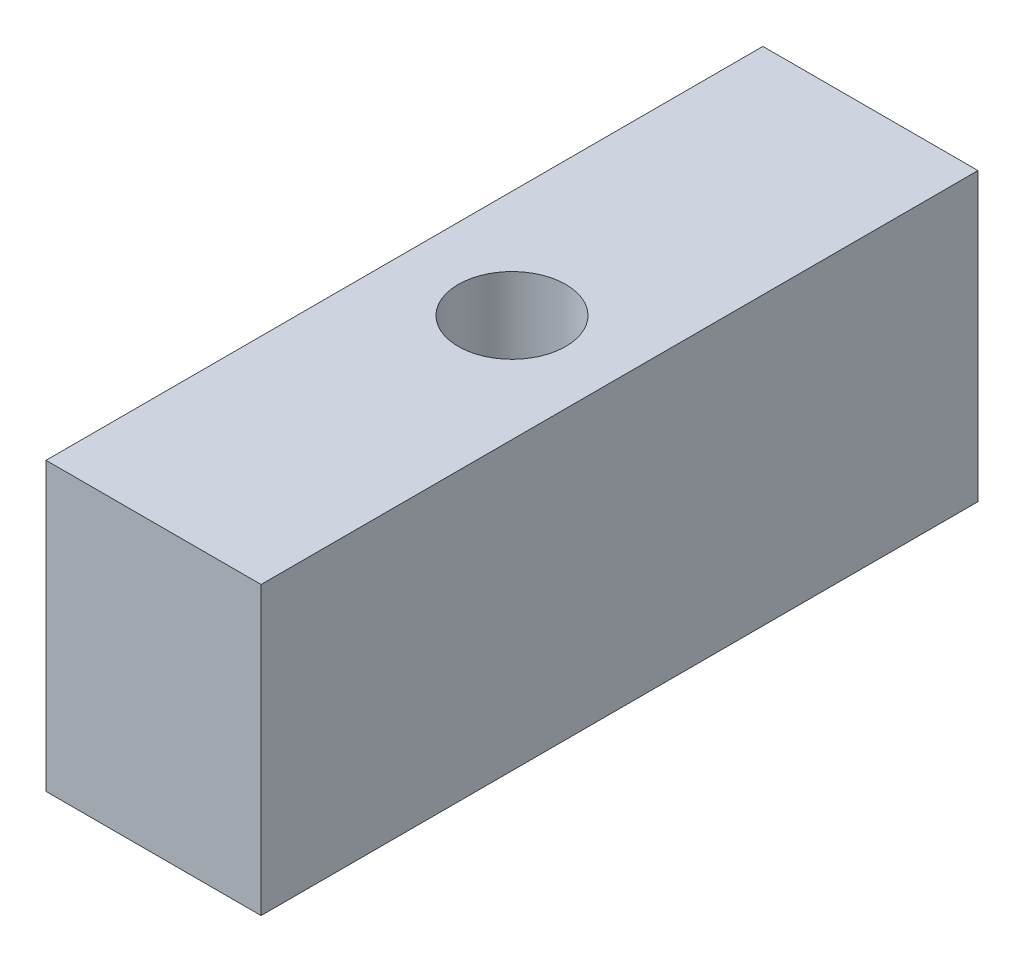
ISO-10303-21;
HEADER;
FILE_DESCRIPTION(('STEP AP214'),'2;1');
FILE_NAME('part.step','',(''),(''),'','','');
FILE_SCHEMA(('AUTOMOTIVE_DESIGN { 1 0 10303 214 1 1 1 1 }'));
ENDSEC;
DATA;
#1=APPLICATION_CONTEXT('core data for automotive mechanical design processes');
#2=APPLICATION_PROTOCOL_DEFINITION('international standard','automotive_design',2000,#1);
#3=PRODUCT_CONTEXT('',#1,'mechanical');
#4=PRODUCT('Part','Part','',(#3));
#5=PRODUCT_RELATED_PRODUCT_CATEGORY('part','',(#4));
#6=PRODUCT_DEFINITION_FORMATION('','',#4);
#7=PRODUCT_DEFINITION_CONTEXT('part definition',#1,'design');
#8=PRODUCT_DEFINITION('design','',#6,#7);
#9=PRODUCT_DEFINITION_SHAPE('','',#8);
#10=(LENGTH_UNIT() NAMED_UNIT(*) SI_UNIT(.MILLI.,.METRE.));
#11=(NAMED_UNIT(*) PLANE_ANGLE_UNIT() SI_UNIT($,.RADIAN.));
#12=(NAMED_UNIT(*) SI_UNIT($,.STERADIAN.) SOLID_ANGLE_UNIT());
#13=UNCERTAINTY_MEASURE_WITH_UNIT(LENGTH_MEASURE(1.E-05),#10,'distance_accuracy_value','');
#14=(GEOMETRIC_REPRESENTATION_CONTEXT(3) GLOBAL_UNCERTAINTY_ASSIGNED_CONTEXT((#13)) GLOBAL_UNIT_ASSIGNED_CONTEXT((#10,
#11,#12)) REPRESENTATION_CONTEXT('',''));
#15=CARTESIAN_POINT('',(0.,0.,0.));
#16=DIRECTION('',(0.,0.,1.));
#17=DIRECTION('',(1.,0.,0.));
#18=AXIS2_PLACEMENT_3D('',#15,#16,#17);
#19=CARTESIAN_POINT('',(0.,0.,10.));
#20=DIRECTION('',(1.,0.,0.));
#21=DIRECTION('',(0.,0.,-1.));
#22=AXIS2_PLACEMENT_3D('',#19,#20,#21);
#23=PLANE('',#22);
#24=DIRECTION('',(0.,-1.,0.));
#25=VECTOR('',#24,1.);
#26=CARTESIAN_POINT('',(0.,0.,0.));
#27=LINE('',#26,#25);
#28=CARTESIAN_POINT('',(0.,4.,0.));
#29=VERTEX_POINT('',#28);
#30=CARTESIAN_POINT('',(0.,0.,0.));
#31=VERTEX_POINT('',#30);
#32=EDGE_CURVE('E75',#29,#31,#27,.T.);
#33=ORIENTED_EDGE('',*,*,#32,.T.);
#34=DIRECTION('',(0.,0.,-1.));
#35=VECTOR('',#34,1.);
#36=CARTESIAN_POINT('',(0.,0.,10.));
#37=LINE('',#36,#35);
#38=CARTESIAN_POINT('',(0.,0.,10.));
#39=VERTEX_POINT('',#38);
#40=EDGE_CURVE('E11',#39,#31,#37,.T.);
#41=ORIENTED_EDGE('',*,*,#40,.F.);
#42=DIRECTION('',(0.,-1.,0.));
#43=VECTOR('',#42,1.);
#44=CARTESIAN_POINT('',(0.,0.,10.));
#45=LINE('',#44,#43);
#46=CARTESIAN_POINT('',(0.,4.,10.));
#47=VERTEX_POINT('',#46);
#48=EDGE_CURVE('E98',#47,#39,#45,.T.);
#49=ORIENTED_EDGE('',*,*,#48,.F.);
#50=DIRECTION('',(0.,0.,-1.));
#51=VECTOR('',#50,1.);
#52=CARTESIAN_POINT('',(0.,4.,10.));
#53=LINE('',#52,#51);
#54=EDGE_CURVE('E87',#47,#29,#53,.T.);
#55=ORIENTED_EDGE('',*,*,#54,.T.);
#56=EDGE_LOOP('',(#33,#41,#49,#55));
#57=FACE_BOUND('',#56,.T.);
#58=ADVANCED_FACE('F31',(#57),#23,.F.);
#59=CARTESIAN_POINT('',(0.,0.,10.));
#60=DIRECTION('',(0.,1.,0.));
#61=DIRECTION('',(0.,0.,1.));
#62=AXIS2_PLACEMENT_3D('',#59,#60,#61);
#63=PLANE('',#62);
#64=CARTESIAN_POINT('',(1.5,0.,5.));
#65=DIRECTION('',(0.,-1.,0.));
#66=DIRECTION('',(0.,0.,-1.));
#67=AXIS2_PLACEMENT_3D('',#64,#65,#66);
#68=CIRCLE('',#67,0.75);
#69=CARTESIAN_POINT('',(1.5,0.,4.25));
#70=VERTEX_POINT('',#69);
#71=EDGE_CURVE('E91',#70,#70,#68,.T.);
#72=ORIENTED_EDGE('',*,*,#71,.F.);
#73=EDGE_LOOP('',(#72));
#74=FACE_BOUND('',#73,.T.);
#75=DIRECTION('',(1.,0.,0.));
#76=VECTOR('',#75,1.);
#77=CARTESIAN_POINT('',(0.,0.,0.));
#78=LINE('',#77,#76);
#79=CARTESIAN_POINT('',(3.,0.,0.));
#80=VERTEX_POINT('',#79);
#81=EDGE_CURVE('E71',#31,#80,#78,.T.);
#82=ORIENTED_EDGE('',*,*,#81,.T.);
#83=DIRECTION('',(0.,0.,-1.));
#84=VECTOR('',#83,1.);
#85=CARTESIAN_POINT('',(3.,0.,10.));
#86=LINE('',#85,#84);
#87=CARTESIAN_POINT('',(3.,0.,10.));
#88=VERTEX_POINT('',#87);
#89=EDGE_CURVE('E38',#88,#80,#86,.T.);
#90=ORIENTED_EDGE('',*,*,#89,.F.);
#91=DIRECTION('',(1.,0.,0.));
#92=VECTOR('',#91,1.);
#93=CARTESIAN_POINT('',(0.,0.,10.));
#94=LINE('',#93,#92);
#95=EDGE_CURVE('E83',#39,#88,#94,.T.);
#96=ORIENTED_EDGE('',*,*,#95,.F.);
#97=ORIENTED_EDGE('',*,*,#40,.T.);
#98=EDGE_LOOP('',(#82,#90,#96,#97));
#99=FACE_BOUND('',#98,.T.);
#100=ADVANCED_FACE('F82',(#74,#99),#63,.F.);
#101=CARTESIAN_POINT('',(3.,0.,10.));
#102=DIRECTION('',(-1.,0.,0.));
#103=DIRECTION('',(0.,-1.,0.));
#104=AXIS2_PLACEMENT_3D('',#101,#102,#103);
#105=PLANE('',#104);
#106=DIRECTION('',(0.,1.,0.));
#107=VECTOR('',#106,1.);
#108=CARTESIAN_POINT('',(3.,0.,0.));
#109=LINE('',#108,#107);
#110=CARTESIAN_POINT('',(3.,4.,0.));
#111=VERTEX_POINT('',#110);
#112=EDGE_CURVE('E76',#80,#111,#109,.T.);
#113=ORIENTED_EDGE('',*,*,#112,.T.);
#114=DIRECTION('',(0.,0.,-1.));
#115=VECTOR('',#114,1.);
#116=CARTESIAN_POINT('',(3.,4.,10.));
#117=LINE('',#116,#115);
#118=CARTESIAN_POINT('',(3.,4.,10.));
#119=VERTEX_POINT('',#118);
#120=EDGE_CURVE('E104',#119,#111,#117,.T.);
#121=ORIENTED_EDGE('',*,*,#120,.F.);
#122=DIRECTION('',(0.,1.,0.));
#123=VECTOR('',#122,1.);
#124=CARTESIAN_POINT('',(3.,0.,10.));
#125=LINE('',#124,#123);
#126=EDGE_CURVE('E50',#88,#119,#125,.T.);
#127=ORIENTED_EDGE('',*,*,#126,.F.);
#128=ORIENTED_EDGE('',*,*,#89,.T.);
#129=EDGE_LOOP('',(#113,#121,#127,#128));
#130=FACE_BOUND('',#129,.T.);
#131=ADVANCED_FACE('F107',(#130),#105,.F.);
#132=CARTESIAN_POINT('',(0.,4.,10.));
#133=DIRECTION('',(0.,-1.,0.));
#134=DIRECTION('',(0.,0.,-1.));
#135=AXIS2_PLACEMENT_3D('',#132,#133,#134);
#136=PLANE('',#135);
#137=CARTESIAN_POINT('',(1.5,4.,5.));
#138=DIRECTION('',(0.,-1.,0.));
#139=DIRECTION('',(0.,0.,-1.));
#140=AXIS2_PLACEMENT_3D('',#137,#138,#139);
#141=CIRCLE('',#140,0.75);
#142=CARTESIAN_POINT('',(1.5,4.,4.25));
#143=VERTEX_POINT('',#142);
#144=EDGE_CURVE('E88',#143,#143,#141,.T.);
#145=ORIENTED_EDGE('',*,*,#144,.T.);
#146=EDGE_LOOP('',(#145));
#147=FACE_BOUND('',#146,.T.);
#148=DIRECTION('',(-1.,0.,0.));
#149=VECTOR('',#148,1.);
#150=CARTESIAN_POINT('',(0.,4.,0.));
#151=LINE('',#150,#149);
#152=EDGE_CURVE('E96',#111,#29,#151,.T.);
#153=ORIENTED_EDGE('',*,*,#152,.T.);
#154=ORIENTED_EDGE('',*,*,#54,.F.);
#155=DIRECTION('',(-1.,0.,0.));
#156=VECTOR('',#155,1.);
#157=CARTESIAN_POINT('',(0.,4.,10.));
#158=LINE('',#157,#156);
#159=EDGE_CURVE('E45',#119,#47,#158,.T.);
#160=ORIENTED_EDGE('',*,*,#159,.F.);
#161=ORIENTED_EDGE('',*,*,#120,.T.);
#162=EDGE_LOOP('',(#153,#154,#160,#161));
#163=FACE_BOUND('',#162,.T.);
#164=ADVANCED_FACE('F109',(#147,#163),#136,.F.);
#165=CARTESIAN_POINT('',(0.,4.,10.));
#166=DIRECTION('',(0.,0.,-1.));
#167=DIRECTION('',(-1.,0.,0.));
#168=AXIS2_PLACEMENT_3D('',#165,#166,#167);
#169=PLANE('',#168);
#170=ORIENTED_EDGE('',*,*,#48,.T.);
#171=ORIENTED_EDGE('',*,*,#95,.T.);
#172=ORIENTED_EDGE('',*,*,#126,.T.);
#173=ORIENTED_EDGE('',*,*,#159,.T.);
#174=EDGE_LOOP('',(#170,#171,#172,#173));
#175=FACE_BOUND('',#174,.T.);
#176=ADVANCED_FACE('F110',(#175),#169,.F.);
#177=CARTESIAN_POINT('',(0.,4.,0.));
#178=DIRECTION('',(0.,0.,-1.));
#179=DIRECTION('',(-1.,0.,0.));
#180=AXIS2_PLACEMENT_3D('',#177,#178,#179);
#181=PLANE('',#180);
#182=ORIENTED_EDGE('',*,*,#32,.F.);
#183=ORIENTED_EDGE('',*,*,#152,.F.);
#184=ORIENTED_EDGE('',*,*,#112,.F.);
#185=ORIENTED_EDGE('',*,*,#81,.F.);
#186=EDGE_LOOP('',(#182,#183,#184,#185));
#187=FACE_BOUND('',#186,.T.);
#188=ADVANCED_FACE('F72',(#187),#181,.T.);
#189=CARTESIAN_POINT('',(1.5,4.,5.));
#190=DIRECTION('',(0.,-1.,0.));
#191=DIRECTION('',(0.,0.,-1.));
#192=AXIS2_PLACEMENT_3D('',#189,#190,#191);
#193=CYLINDRICAL_SURFACE('',#192,0.75);
#194=ORIENTED_EDGE('',*,*,#144,.F.);
#195=EDGE_LOOP('',(#194));
#196=FACE_BOUND('',#195,.T.);
#197=ORIENTED_EDGE('',*,*,#71,.T.);
#198=EDGE_LOOP('',(#197));
#199=FACE_BOUND('',#198,.T.);
#200=ADVANCED_FACE('F117',(#196,#199),#193,.F.);
#201=CLOSED_SHELL('',(#58,#100,#131,#164,#176,#188,#200));
#202=MANIFOLD_SOLID_BREP('B2',#201);
#203=ADVANCED_BREP_SHAPE_REPRESENTATION('',(#18,#202),#14);
#204=SHAPE_DEFINITION_REPRESENTATION(#9,#203);
ENDSEC;
END-ISO-10303-21;
